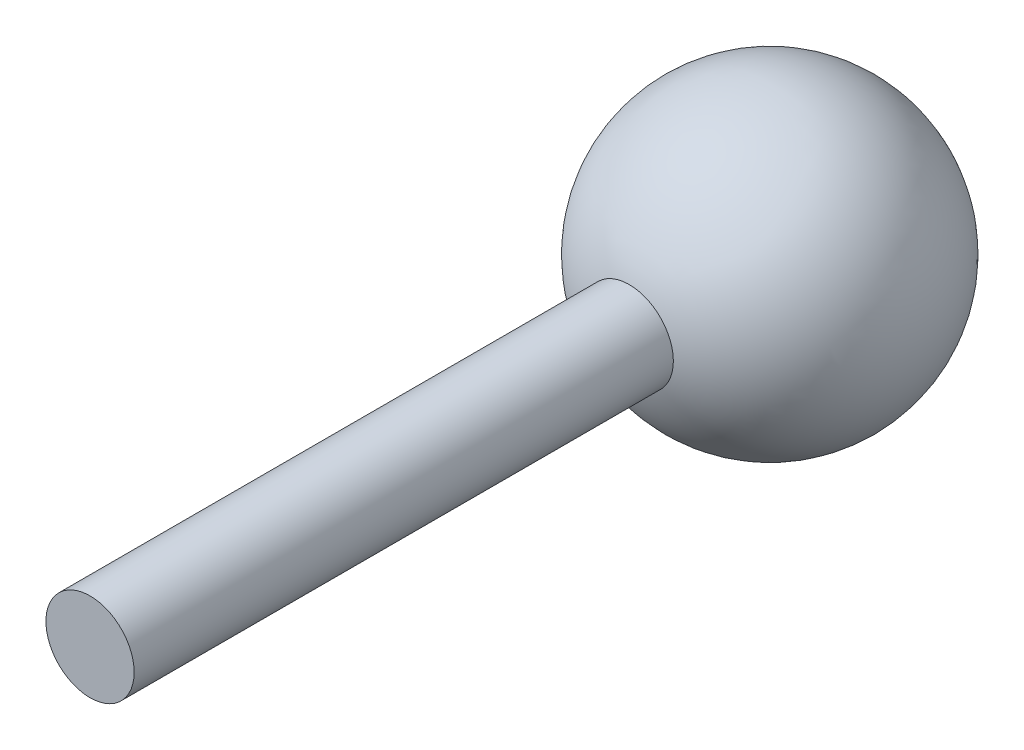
ISO-10303-21;
HEADER;
FILE_DESCRIPTION(('STEP AP214'),'2;1');
FILE_NAME('part.step','',(''),(''),'','','');
FILE_SCHEMA(('AUTOMOTIVE_DESIGN { 1 0 10303 214 1 1 1 1 }'));
ENDSEC;
DATA;
#1=APPLICATION_CONTEXT('core data for automotive mechanical design processes');
#2=APPLICATION_PROTOCOL_DEFINITION('international standard','automotive_design',2000,#1);
#3=PRODUCT_CONTEXT('',#1,'mechanical');
#4=PRODUCT('Part','Part','',(#3));
#5=PRODUCT_RELATED_PRODUCT_CATEGORY('part','',(#4));
#6=PRODUCT_DEFINITION_FORMATION('','',#4);
#7=PRODUCT_DEFINITION_CONTEXT('part definition',#1,'design');
#8=PRODUCT_DEFINITION('design','',#6,#7);
#9=PRODUCT_DEFINITION_SHAPE('','',#8);
#10=(LENGTH_UNIT() NAMED_UNIT(*) SI_UNIT(.MILLI.,.METRE.));
#11=(NAMED_UNIT(*) PLANE_ANGLE_UNIT() SI_UNIT($,.RADIAN.));
#12=(NAMED_UNIT(*) SI_UNIT($,.STERADIAN.) SOLID_ANGLE_UNIT());
#13=UNCERTAINTY_MEASURE_WITH_UNIT(LENGTH_MEASURE(1.E-05),#10,'distance_accuracy_value','');
#14=(GEOMETRIC_REPRESENTATION_CONTEXT(3) GLOBAL_UNCERTAINTY_ASSIGNED_CONTEXT((#13)) GLOBAL_UNIT_ASSIGNED_CONTEXT((#10,
#11,#12)) REPRESENTATION_CONTEXT('',''));
#15=CARTESIAN_POINT('',(0.,0.,0.));
#16=DIRECTION('',(0.,0.,1.));
#17=DIRECTION('',(1.,0.,0.));
#18=AXIS2_PLACEMENT_3D('',#15,#16,#17);
#19=CARTESIAN_POINT('',(0.,0.,11.6606960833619));
#20=DIRECTION('',(0.,0.,1.));
#21=DIRECTION('',(1.,0.,0.));
#22=AXIS2_PLACEMENT_3D('',#19,#20,#21);
#23=SPHERICAL_SURFACE('',#22,11.6606960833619);
#24=CARTESIAN_POINT('',(0.,0.,22.7858052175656));
#25=DIRECTION('',(0.,0.,1.));
#26=DIRECTION('',(1.,0.,0.));
#27=AXIS2_PLACEMENT_3D('',#24,#25,#26);
#28=CIRCLE('',#27,3.49339088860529);
#29=CARTESIAN_POINT('',(3.49339088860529,0.,22.7858052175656));
#30=VERTEX_POINT('',#29);
#31=EDGE_CURVE('E10',#30,#30,#28,.T.);
#32=ORIENTED_EDGE('',*,*,#31,.F.);
#33=EDGE_LOOP('',(#32));
#34=FACE_BOUND('',#33,.T.);
#35=ADVANCED_FACE('F31',(#34),#23,.T.);
#36=CARTESIAN_POINT('',(0.,0.,0.));
#37=DIRECTION('',(0.,0.,1.));
#38=DIRECTION('',(1.,0.,0.));
#39=AXIS2_PLACEMENT_3D('',#36,#37,#38);
#40=CYLINDRICAL_SURFACE('',#39,3.49339088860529);
#41=ORIENTED_EDGE('',*,*,#31,.T.);
#42=EDGE_LOOP('',(#41));
#43=FACE_BOUND('',#42,.T.);
#44=CARTESIAN_POINT('',(0.,0.,65.4767826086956));
#45=DIRECTION('',(0.,0.,1.));
#46=DIRECTION('',(1.,0.,0.));
#47=AXIS2_PLACEMENT_3D('',#44,#45,#46);
#48=CIRCLE('',#47,3.49339088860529);
#49=CARTESIAN_POINT('',(3.49339088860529,0.,65.4767826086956));
#50=VERTEX_POINT('',#49);
#51=EDGE_CURVE('E37',#50,#50,#48,.T.);
#52=ORIENTED_EDGE('',*,*,#51,.F.);
#53=EDGE_LOOP('',(#52));
#54=FACE_BOUND('',#53,.T.);
#55=ADVANCED_FACE('F45',(#43,#54),#40,.T.);
#56=CARTESIAN_POINT('',(0.,0.,65.4767826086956));
#57=DIRECTION('',(0.,0.,1.));
#58=DIRECTION('',(1.,0.,0.));
#59=AXIS2_PLACEMENT_3D('',#56,#57,#58);
#60=PLANE('',#59);
#61=ORIENTED_EDGE('',*,*,#51,.T.);
#62=EDGE_LOOP('',(#61));
#63=FACE_BOUND('',#62,.T.);
#64=ADVANCED_FACE('F43',(#63),#60,.T.);
#65=CLOSED_SHELL('',(#35,#55,#64));
#66=MANIFOLD_SOLID_BREP('B2',#65);
#67=ADVANCED_BREP_SHAPE_REPRESENTATION('',(#18,#66),#14);
#68=SHAPE_DEFINITION_REPRESENTATION(#9,#67);
ENDSEC;
END-ISO-10303-21;
